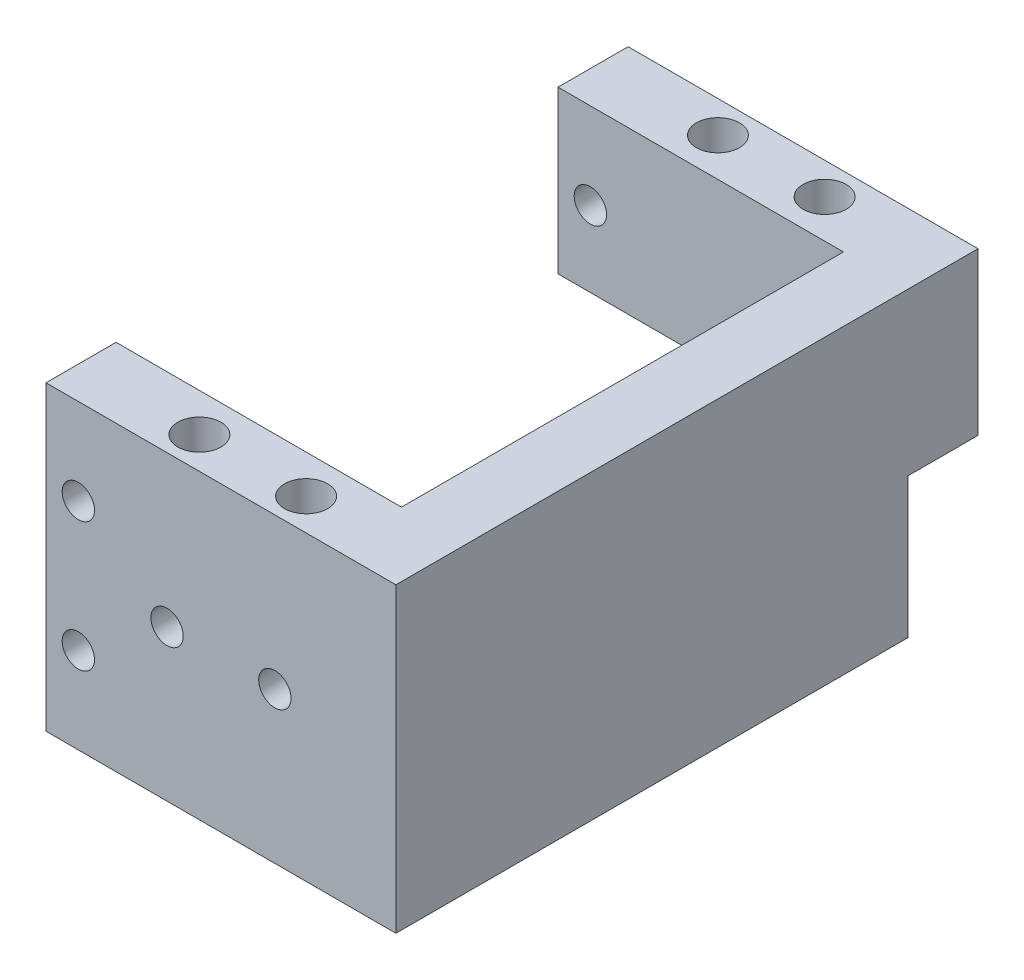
ISO-10303-21;
HEADER;
FILE_DESCRIPTION(('STEP AP214'),'2;1');
FILE_NAME('part.step','',(''),(''),'','','');
FILE_SCHEMA(('AUTOMOTIVE_DESIGN { 1 0 10303 214 1 1 1 1 }'));
ENDSEC;
DATA;
#1=APPLICATION_CONTEXT('core data for automotive mechanical design processes');
#2=APPLICATION_PROTOCOL_DEFINITION('international standard','automotive_design',2000,#1);
#3=PRODUCT_CONTEXT('',#1,'mechanical');
#4=PRODUCT('Part','Part','',(#3));
#5=PRODUCT_RELATED_PRODUCT_CATEGORY('part','',(#4));
#6=PRODUCT_DEFINITION_FORMATION('','',#4);
#7=PRODUCT_DEFINITION_CONTEXT('part definition',#1,'design');
#8=PRODUCT_DEFINITION('design','',#6,#7);
#9=PRODUCT_DEFINITION_SHAPE('','',#8);
#10=(LENGTH_UNIT() NAMED_UNIT(*) SI_UNIT(.MILLI.,.METRE.));
#11=(NAMED_UNIT(*) PLANE_ANGLE_UNIT() SI_UNIT($,.RADIAN.));
#12=(NAMED_UNIT(*) SI_UNIT($,.STERADIAN.) SOLID_ANGLE_UNIT());
#13=UNCERTAINTY_MEASURE_WITH_UNIT(LENGTH_MEASURE(1.E-05),#10,'distance_accuracy_value','');
#14=(GEOMETRIC_REPRESENTATION_CONTEXT(3) GLOBAL_UNCERTAINTY_ASSIGNED_CONTEXT((#13)) GLOBAL_UNIT_ASSIGNED_CONTEXT((#10,
#11,#12)) REPRESENTATION_CONTEXT('',''));
#15=CARTESIAN_POINT('',(0.,0.,0.));
#16=DIRECTION('',(0.,0.,1.));
#17=DIRECTION('',(1.,0.,0.));
#18=AXIS2_PLACEMENT_3D('',#15,#16,#17);
#19=CARTESIAN_POINT('',(-16.23,28.,0.));
#20=DIRECTION('',(-1.,0.,0.));
#21=DIRECTION('',(0.,0.,1.));
#22=AXIS2_PLACEMENT_3D('',#19,#20,#21);
#23=PLANE('',#22);
#24=DIRECTION('',(0.,-1.,0.));
#25=VECTOR('',#24,1.);
#26=CARTESIAN_POINT('',(-16.23,0.,-23.75));
#27=LINE('',#26,#25);
#28=CARTESIAN_POINT('',(-16.23,28.,-23.75));
#29=VERTEX_POINT('',#28);
#30=CARTESIAN_POINT('',(-16.23,13.,-23.75));
#31=VERTEX_POINT('',#30);
#32=EDGE_CURVE('E129',#29,#31,#27,.T.);
#33=ORIENTED_EDGE('',*,*,#32,.F.);
#34=DIRECTION('',(0.,0.,-1.));
#35=VECTOR('',#34,1.);
#36=CARTESIAN_POINT('',(-16.23,28.,0.));
#37=LINE('',#36,#35);
#38=CARTESIAN_POINT('',(-16.23,28.,-30.25));
#39=VERTEX_POINT('',#38);
#40=EDGE_CURVE('E120',#29,#39,#37,.T.);
#41=ORIENTED_EDGE('',*,*,#40,.T.);
#42=DIRECTION('',(0.,-1.,0.));
#43=VECTOR('',#42,1.);
#44=CARTESIAN_POINT('',(-16.23,28.,-30.25));
#45=LINE('',#44,#43);
#46=CARTESIAN_POINT('',(-16.23,13.,-30.25));
#47=VERTEX_POINT('',#46);
#48=EDGE_CURVE('E208',#39,#47,#45,.T.);
#49=ORIENTED_EDGE('',*,*,#48,.T.);
#50=DIRECTION('',(0.,0.,1.));
#51=VECTOR('',#50,1.);
#52=CARTESIAN_POINT('',(-16.23,13.,-23.75));
#53=LINE('',#52,#51);
#54=EDGE_CURVE('E213',#47,#31,#53,.T.);
#55=ORIENTED_EDGE('',*,*,#54,.T.);
#56=EDGE_LOOP('',(#33,#41,#49,#55));
#57=FACE_BOUND('',#56,.T.);
#58=ADVANCED_FACE('F35',(#57),#23,.T.);
#59=CARTESIAN_POINT('',(0.,28.,17.25));
#60=DIRECTION('',(0.,0.,-1.));
#61=DIRECTION('',(-1.,0.,0.));
#62=AXIS2_PLACEMENT_3D('',#59,#60,#61);
#63=PLANE('',#62);
#64=CARTESIAN_POINT('',(-13.23,20.,17.25));
#65=DIRECTION('',(0.,0.,-1.));
#66=DIRECTION('',(-1.,0.,0.));
#67=AXIS2_PLACEMENT_3D('',#64,#65,#66);
#68=CIRCLE('',#67,1.5);
#69=CARTESIAN_POINT('',(-14.73,20.,17.25));
#70=VERTEX_POINT('',#69);
#71=EDGE_CURVE('E406',#70,#70,#68,.T.);
#72=ORIENTED_EDGE('',*,*,#71,.F.);
#73=EDGE_LOOP('',(#72));
#74=FACE_BOUND('',#73,.T.);
#75=CARTESIAN_POINT('',(-13.23,7.99999999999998,17.25));
#76=DIRECTION('',(0.,0.,-1.));
#77=DIRECTION('',(-1.,0.,0.));
#78=AXIS2_PLACEMENT_3D('',#75,#76,#77);
#79=CIRCLE('',#78,1.5);
#80=CARTESIAN_POINT('',(-14.73,7.99999999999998,17.25));
#81=VERTEX_POINT('',#80);
#82=EDGE_CURVE('E318',#81,#81,#79,.T.);
#83=ORIENTED_EDGE('',*,*,#82,.F.);
#84=EDGE_LOOP('',(#83));
#85=FACE_BOUND('',#84,.T.);
#86=CARTESIAN_POINT('',(5.,14.,17.25));
#87=DIRECTION('',(0.,0.,-1.));
#88=DIRECTION('',(-1.,0.,0.));
#89=AXIS2_PLACEMENT_3D('',#86,#87,#88);
#90=CIRCLE('',#89,3.);
#91=CARTESIAN_POINT('',(2.,14.,17.25));
#92=VERTEX_POINT('',#91);
#93=EDGE_CURVE('E327',#92,#92,#90,.T.);
#94=ORIENTED_EDGE('',*,*,#93,.F.);
#95=EDGE_LOOP('',(#94));
#96=FACE_BOUND('',#95,.T.);
#97=DIRECTION('',(1.,0.,0.));
#98=VECTOR('',#97,1.);
#99=CARTESIAN_POINT('',(0.,0.,17.25));
#100=LINE('',#99,#98);
#101=CARTESIAN_POINT('',(-16.23,0.,17.25));
#102=VERTEX_POINT('',#101);
#103=CARTESIAN_POINT('',(10.25,0.,17.25));
#104=VERTEX_POINT('',#103);
#105=EDGE_CURVE('E51',#102,#104,#100,.T.);
#106=ORIENTED_EDGE('',*,*,#105,.F.);
#107=DIRECTION('',(0.,1.,0.));
#108=VECTOR('',#107,1.);
#109=CARTESIAN_POINT('',(-16.23,0.,17.25));
#110=LINE('',#109,#108);
#111=CARTESIAN_POINT('',(-16.23,28.,17.25));
#112=VERTEX_POINT('',#111);
#113=EDGE_CURVE('E122',#102,#112,#110,.T.);
#114=ORIENTED_EDGE('',*,*,#113,.T.);
#115=DIRECTION('',(1.,0.,0.));
#116=VECTOR('',#115,1.);
#117=CARTESIAN_POINT('',(0.,28.,17.25));
#118=LINE('',#117,#116);
#119=CARTESIAN_POINT('',(10.25,28.,17.25));
#120=VERTEX_POINT('',#119);
#121=EDGE_CURVE('E111',#112,#120,#118,.T.);
#122=ORIENTED_EDGE('',*,*,#121,.T.);
#123=DIRECTION('',(0.,-1.,0.));
#124=VECTOR('',#123,1.);
#125=CARTESIAN_POINT('',(10.25,28.,17.25));
#126=LINE('',#125,#124);
#127=EDGE_CURVE('E11',#120,#104,#126,.T.);
#128=ORIENTED_EDGE('',*,*,#127,.T.);
#129=EDGE_LOOP('',(#106,#114,#122,#128));
#130=FACE_BOUND('',#129,.T.);
#131=CARTESIAN_POINT('',(-5.,14.,17.25));
#132=DIRECTION('',(0.,0.,-1.));
#133=DIRECTION('',(-1.,0.,0.));
#134=AXIS2_PLACEMENT_3D('',#131,#132,#133);
#135=CIRCLE('',#134,3.);
#136=CARTESIAN_POINT('',(-8.00000000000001,14.,17.25));
#137=VERTEX_POINT('',#136);
#138=EDGE_CURVE('E128',#137,#137,#135,.F.);
#139=ORIENTED_EDGE('',*,*,#138,.T.);
#140=EDGE_LOOP('',(#139));
#141=FACE_BOUND('',#140,.T.);
#142=ADVANCED_FACE('F123',(#74,#85,#96,#130,#141),#63,.T.);
#143=CARTESIAN_POINT('',(-5.,14.,27.25));
#144=DIRECTION('',(0.,0.,-1.));
#145=DIRECTION('',(-1.,0.,0.));
#146=AXIS2_PLACEMENT_3D('',#143,#144,#145);
#147=CYLINDRICAL_SURFACE('',#146,1.5);
#148=CARTESIAN_POINT('',(-5.,14.,23.75));
#149=DIRECTION('',(0.,0.,-1.));
#150=DIRECTION('',(-1.,0.,0.));
#151=AXIS2_PLACEMENT_3D('',#148,#149,#150);
#152=CIRCLE('',#151,1.5);
#153=CARTESIAN_POINT('',(-6.5,14.,23.75));
#154=VERTEX_POINT('',#153);
#155=EDGE_CURVE('E174',#154,#154,#152,.F.);
#156=ORIENTED_EDGE('',*,*,#155,.T.);
#157=EDGE_LOOP('',(#156));
#158=FACE_BOUND('',#157,.T.);
#159=CARTESIAN_POINT('',(-5.,14.,20.75));
#160=DIRECTION('',(0.,0.,-1.));
#161=DIRECTION('',(-1.,0.,0.));
#162=AXIS2_PLACEMENT_3D('',#159,#160,#161);
#163=CIRCLE('',#162,1.5);
#164=CARTESIAN_POINT('',(-6.5,14.,20.75));
#165=VERTEX_POINT('',#164);
#166=EDGE_CURVE('E332',#165,#165,#163,.F.);
#167=ORIENTED_EDGE('',*,*,#166,.F.);
#168=EDGE_LOOP('',(#167));
#169=FACE_BOUND('',#168,.T.);
#170=ADVANCED_FACE('F276',(#158,#169),#147,.F.);
#171=CARTESIAN_POINT('',(5.,14.,27.25));
#172=DIRECTION('',(0.,0.,-1.));
#173=DIRECTION('',(-1.,0.,0.));
#174=AXIS2_PLACEMENT_3D('',#171,#172,#173);
#175=CYLINDRICAL_SURFACE('',#174,1.5);
#176=CARTESIAN_POINT('',(5.,14.,23.75));
#177=DIRECTION('',(0.,0.,-1.));
#178=DIRECTION('',(-1.,0.,0.));
#179=AXIS2_PLACEMENT_3D('',#176,#177,#178);
#180=CIRCLE('',#179,1.5);
#181=CARTESIAN_POINT('',(3.5,14.,23.75));
#182=VERTEX_POINT('',#181);
#183=EDGE_CURVE('E176',#182,#182,#180,.T.);
#184=ORIENTED_EDGE('',*,*,#183,.F.);
#185=EDGE_LOOP('',(#184));
#186=FACE_BOUND('',#185,.T.);
#187=CARTESIAN_POINT('',(5.,14.,20.75));
#188=DIRECTION('',(0.,0.,-1.));
#189=DIRECTION('',(-1.,0.,0.));
#190=AXIS2_PLACEMENT_3D('',#187,#188,#189);
#191=CIRCLE('',#190,1.5);
#192=CARTESIAN_POINT('',(3.5,14.,20.75));
#193=VERTEX_POINT('',#192);
#194=EDGE_CURVE('E324',#193,#193,#191,.T.);
#195=ORIENTED_EDGE('',*,*,#194,.T.);
#196=EDGE_LOOP('',(#195));
#197=FACE_BOUND('',#196,.T.);
#198=ADVANCED_FACE('F392',(#186,#197),#175,.F.);
#199=CARTESIAN_POINT('',(0.,28.,23.75));
#200=DIRECTION('',(0.,0.,-1.));
#201=DIRECTION('',(-1.,0.,0.));
#202=AXIS2_PLACEMENT_3D('',#199,#200,#201);
#203=PLANE('',#202);
#204=CARTESIAN_POINT('',(-13.23,20.,23.75));
#205=DIRECTION('',(0.,0.,-1.));
#206=DIRECTION('',(-1.,0.,0.));
#207=AXIS2_PLACEMENT_3D('',#204,#205,#206);
#208=CIRCLE('',#207,1.5);
#209=CARTESIAN_POINT('',(-14.73,20.,23.75));
#210=VERTEX_POINT('',#209);
#211=EDGE_CURVE('E402',#210,#210,#208,.T.);
#212=ORIENTED_EDGE('',*,*,#211,.T.);
#213=EDGE_LOOP('',(#212));
#214=FACE_BOUND('',#213,.T.);
#215=CARTESIAN_POINT('',(-13.23,7.99999999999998,23.75));
#216=DIRECTION('',(0.,0.,-1.));
#217=DIRECTION('',(-1.,0.,0.));
#218=AXIS2_PLACEMENT_3D('',#215,#216,#217);
#219=CIRCLE('',#218,1.5);
#220=CARTESIAN_POINT('',(-14.73,7.99999999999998,23.75));
#221=VERTEX_POINT('',#220);
#222=EDGE_CURVE('E39',#221,#221,#219,.T.);
#223=ORIENTED_EDGE('',*,*,#222,.T.);
#224=EDGE_LOOP('',(#223));
#225=FACE_BOUND('',#224,.T.);
#226=DIRECTION('',(1.,0.,0.));
#227=VECTOR('',#226,1.);
#228=CARTESIAN_POINT('',(0.,0.,23.75));
#229=LINE('',#228,#227);
#230=CARTESIAN_POINT('',(-16.23,0.,23.75));
#231=VERTEX_POINT('',#230);
#232=CARTESIAN_POINT('',(16.23,0.,23.75));
#233=VERTEX_POINT('',#232);
#234=EDGE_CURVE('E148',#231,#233,#229,.T.);
#235=ORIENTED_EDGE('',*,*,#234,.T.);
#236=DIRECTION('',(0.,-1.,0.));
#237=VECTOR('',#236,1.);
#238=CARTESIAN_POINT('',(16.23,28.,23.75));
#239=LINE('',#238,#237);
#240=CARTESIAN_POINT('',(16.23,28.,23.75));
#241=VERTEX_POINT('',#240);
#242=EDGE_CURVE('E161',#241,#233,#239,.T.);
#243=ORIENTED_EDGE('',*,*,#242,.F.);
#244=DIRECTION('',(1.,0.,0.));
#245=VECTOR('',#244,1.);
#246=CARTESIAN_POINT('',(0.,28.,23.75));
#247=LINE('',#246,#245);
#248=CARTESIAN_POINT('',(-16.23,28.,23.75));
#249=VERTEX_POINT('',#248);
#250=EDGE_CURVE('E133',#249,#241,#247,.T.);
#251=ORIENTED_EDGE('',*,*,#250,.F.);
#252=DIRECTION('',(0.,-1.,0.));
#253=VECTOR('',#252,1.);
#254=CARTESIAN_POINT('',(-16.23,28.,23.75));
#255=LINE('',#254,#253);
#256=EDGE_CURVE('E44',#249,#231,#255,.T.);
#257=ORIENTED_EDGE('',*,*,#256,.T.);
#258=EDGE_LOOP('',(#235,#243,#251,#257));
#259=FACE_BOUND('',#258,.T.);
#260=ORIENTED_EDGE('',*,*,#155,.F.);
#261=EDGE_LOOP('',(#260));
#262=FACE_BOUND('',#261,.T.);
#263=ORIENTED_EDGE('',*,*,#183,.T.);
#264=EDGE_LOOP('',(#263));
#265=FACE_BOUND('',#264,.T.);
#266=ADVANCED_FACE('F246',(#214,#225,#259,#262,#265),#203,.F.);
#267=CARTESIAN_POINT('',(0.,0.,0.));
#268=DIRECTION('',(0.,1.,0.));
#269=DIRECTION('',(0.,0.,1.));
#270=AXIS2_PLACEMENT_3D('',#267,#268,#269);
#271=PLANE('',#270);
#272=CARTESIAN_POINT('',(13.23,0.,13.25));
#273=DIRECTION('',(0.,1.,0.));
#274=DIRECTION('',(0.,0.,1.));
#275=AXIS2_PLACEMENT_3D('',#272,#273,#274);
#276=CIRCLE('',#275,1.5);
#277=CARTESIAN_POINT('',(13.23,0.,14.75));
#278=VERTEX_POINT('',#277);
#279=EDGE_CURVE('E222',#278,#278,#276,.T.);
#280=ORIENTED_EDGE('',*,*,#279,.T.);
#281=EDGE_LOOP('',(#280));
#282=FACE_BOUND('',#281,.T.);
#283=DIRECTION('',(0.,0.,-1.));
#284=VECTOR('',#283,1.);
#285=CARTESIAN_POINT('',(-16.23,0.,0.));
#286=LINE('',#285,#284);
#287=EDGE_CURVE('E146',#231,#102,#286,.T.);
#288=ORIENTED_EDGE('',*,*,#287,.T.);
#289=ORIENTED_EDGE('',*,*,#105,.T.);
#290=DIRECTION('',(0.,0.,1.));
#291=VECTOR('',#290,1.);
#292=CARTESIAN_POINT('',(10.25,0.,0.));
#293=LINE('',#292,#291);
#294=CARTESIAN_POINT('',(10.25,0.,-23.75));
#295=VERTEX_POINT('',#294);
#296=EDGE_CURVE('E141',#295,#104,#293,.T.);
#297=ORIENTED_EDGE('',*,*,#296,.F.);
#298=DIRECTION('',(1.,0.,0.));
#299=VECTOR('',#298,1.);
#300=CARTESIAN_POINT('',(0.,0.,-23.75));
#301=LINE('',#300,#299);
#302=CARTESIAN_POINT('',(16.23,0.,-23.75));
#303=VERTEX_POINT('',#302);
#304=EDGE_CURVE('E153',#295,#303,#301,.T.);
#305=ORIENTED_EDGE('',*,*,#304,.T.);
#306=DIRECTION('',(0.,0.,-1.));
#307=VECTOR('',#306,1.);
#308=CARTESIAN_POINT('',(16.23,0.,0.));
#309=LINE('',#308,#307);
#310=EDGE_CURVE('E150',#233,#303,#309,.T.);
#311=ORIENTED_EDGE('',*,*,#310,.F.);
#312=ORIENTED_EDGE('',*,*,#234,.F.);
#313=EDGE_LOOP('',(#288,#289,#297,#305,#311,#312));
#314=FACE_BOUND('',#313,.T.);
#315=CARTESIAN_POINT('',(13.23,0.,-19.75));
#316=DIRECTION('',(0.,1.,0.));
#317=DIRECTION('',(0.,0.,1.));
#318=AXIS2_PLACEMENT_3D('',#315,#316,#317);
#319=CIRCLE('',#318,1.5);
#320=CARTESIAN_POINT('',(13.23,0.,-18.25));
#321=VERTEX_POINT('',#320);
#322=EDGE_CURVE('E233',#321,#321,#319,.F.);
#323=ORIENTED_EDGE('',*,*,#322,.F.);
#324=EDGE_LOOP('',(#323));
#325=FACE_BOUND('',#324,.T.);
#326=CARTESIAN_POINT('',(4.95,0.,20.8));
#327=DIRECTION('',(0.,1.,0.));
#328=DIRECTION('',(0.,0.,1.));
#329=AXIS2_PLACEMENT_3D('',#326,#327,#328);
#330=CIRCLE('',#329,2.);
#331=CARTESIAN_POINT('',(4.95,0.,22.8));
#332=VERTEX_POINT('',#331);
#333=EDGE_CURVE('E200',#332,#332,#330,.T.);
#334=ORIENTED_EDGE('',*,*,#333,.T.);
#335=EDGE_LOOP('',(#334));
#336=FACE_BOUND('',#335,.T.);
#337=CARTESIAN_POINT('',(-4.95,0.,20.8));
#338=DIRECTION('',(0.,1.,0.));
#339=DIRECTION('',(0.,0.,1.));
#340=AXIS2_PLACEMENT_3D('',#337,#338,#339);
#341=CIRCLE('',#340,2.);
#342=CARTESIAN_POINT('',(-4.95,0.,22.8));
#343=VERTEX_POINT('',#342);
#344=EDGE_CURVE('E194',#343,#343,#341,.F.);
#345=ORIENTED_EDGE('',*,*,#344,.F.);
#346=EDGE_LOOP('',(#345));
#347=FACE_BOUND('',#346,.T.);
#348=ADVANCED_FACE('F243',(#282,#314,#325,#336,#347),#271,.F.);
#349=CARTESIAN_POINT('',(0.,28.,0.));
#350=DIRECTION('',(0.,1.,0.));
#351=DIRECTION('',(0.,0.,1.));
#352=AXIS2_PLACEMENT_3D('',#349,#350,#351);
#353=PLANE('',#352);
#354=ORIENTED_EDGE('',*,*,#40,.F.);
#355=DIRECTION('',(-1.,0.,0.));
#356=VECTOR('',#355,1.);
#357=CARTESIAN_POINT('',(16.23,28.,-23.75));
#358=LINE('',#357,#356);
#359=CARTESIAN_POINT('',(10.25,28.,-23.75));
#360=VERTEX_POINT('',#359);
#361=EDGE_CURVE('E216',#360,#29,#358,.T.);
#362=ORIENTED_EDGE('',*,*,#361,.F.);
#363=DIRECTION('',(0.,0.,1.));
#364=VECTOR('',#363,1.);
#365=CARTESIAN_POINT('',(10.25,28.,0.));
#366=LINE('',#365,#364);
#367=EDGE_CURVE('E118',#360,#120,#366,.T.);
#368=ORIENTED_EDGE('',*,*,#367,.T.);
#369=ORIENTED_EDGE('',*,*,#121,.F.);
#370=EDGE_CURVE('E116',#249,#112,#37,.T.);
#371=ORIENTED_EDGE('',*,*,#370,.F.);
#372=ORIENTED_EDGE('',*,*,#250,.T.);
#373=DIRECTION('',(0.,0.,-1.));
#374=VECTOR('',#373,1.);
#375=CARTESIAN_POINT('',(16.23,28.,0.));
#376=LINE('',#375,#374);
#377=CARTESIAN_POINT('',(16.23,28.,-30.25));
#378=VERTEX_POINT('',#377);
#379=EDGE_CURVE('E135',#241,#378,#376,.T.);
#380=ORIENTED_EDGE('',*,*,#379,.T.);
#381=DIRECTION('',(-1.,0.,0.));
#382=VECTOR('',#381,1.);
#383=CARTESIAN_POINT('',(16.23,28.,-30.25));
#384=LINE('',#383,#382);
#385=EDGE_CURVE('E226',#378,#39,#384,.T.);
#386=ORIENTED_EDGE('',*,*,#385,.T.);
#387=EDGE_LOOP('',(#354,#362,#368,#369,#371,#372,#380,#386));
#388=FACE_BOUND('',#387,.T.);
#389=CARTESIAN_POINT('',(-4.95,28.,20.8));
#390=DIRECTION('',(0.,1.,0.));
#391=DIRECTION('',(0.,0.,1.));
#392=AXIS2_PLACEMENT_3D('',#389,#390,#391);
#393=CIRCLE('',#392,2.);
#394=CARTESIAN_POINT('',(-4.95,28.,22.8));
#395=VERTEX_POINT('',#394);
#396=EDGE_CURVE('E188',#395,#395,#393,.T.);
#397=ORIENTED_EDGE('',*,*,#396,.F.);
#398=EDGE_LOOP('',(#397));
#399=FACE_BOUND('',#398,.T.);
#400=CARTESIAN_POINT('',(4.95,28.,20.8));
#401=DIRECTION('',(0.,1.,0.));
#402=DIRECTION('',(0.,0.,1.));
#403=AXIS2_PLACEMENT_3D('',#400,#401,#402);
#404=CIRCLE('',#403,2.);
#405=CARTESIAN_POINT('',(4.95,28.,22.8));
#406=VERTEX_POINT('',#405);
#407=EDGE_CURVE('E179',#406,#406,#404,.T.);
#408=ORIENTED_EDGE('',*,*,#407,.F.);
#409=EDGE_LOOP('',(#408));
#410=FACE_BOUND('',#409,.T.);
#411=CARTESIAN_POINT('',(4.95,28.,-27.3));
#412=DIRECTION('',(0.,1.,0.));
#413=DIRECTION('',(0.,0.,1.));
#414=AXIS2_PLACEMENT_3D('',#411,#412,#413);
#415=CIRCLE('',#414,2.);
#416=CARTESIAN_POINT('',(4.95,28.,-25.3));
#417=VERTEX_POINT('',#416);
#418=EDGE_CURVE('E168',#417,#417,#415,.T.);
#419=ORIENTED_EDGE('',*,*,#418,.F.);
#420=EDGE_LOOP('',(#419));
#421=FACE_BOUND('',#420,.T.);
#422=CARTESIAN_POINT('',(-4.95,28.,-27.3));
#423=DIRECTION('',(0.,1.,0.));
#424=DIRECTION('',(0.,0.,1.));
#425=AXIS2_PLACEMENT_3D('',#422,#423,#424);
#426=CIRCLE('',#425,2.);
#427=CARTESIAN_POINT('',(-4.95,28.,-25.3));
#428=VERTEX_POINT('',#427);
#429=EDGE_CURVE('E173',#428,#428,#426,.F.);
#430=ORIENTED_EDGE('',*,*,#429,.T.);
#431=EDGE_LOOP('',(#430));
#432=FACE_BOUND('',#431,.T.);
#433=ADVANCED_FACE('F113',(#388,#399,#410,#421,#432),#353,.T.);
#434=CARTESIAN_POINT('',(16.23,13.,-23.75));
#435=DIRECTION('',(0.,-1.,0.));
#436=DIRECTION('',(0.,0.,-1.));
#437=AXIS2_PLACEMENT_3D('',#434,#435,#436);
#438=PLANE('',#437);
#439=ORIENTED_EDGE('',*,*,#54,.F.);
#440=DIRECTION('',(-1.,0.,0.));
#441=VECTOR('',#440,1.);
#442=CARTESIAN_POINT('',(16.23,13.,-30.25));
#443=LINE('',#442,#441);
#444=CARTESIAN_POINT('',(16.23,13.,-30.25));
#445=VERTEX_POINT('',#444);
#446=EDGE_CURVE('E224',#445,#47,#443,.T.);
#447=ORIENTED_EDGE('',*,*,#446,.F.);
#448=DIRECTION('',(0.,0.,1.));
#449=VECTOR('',#448,1.);
#450=CARTESIAN_POINT('',(16.23,13.,-23.75));
#451=LINE('',#450,#449);
#452=CARTESIAN_POINT('',(16.23,13.,-23.75));
#453=VERTEX_POINT('',#452);
#454=EDGE_CURVE('E212',#445,#453,#451,.T.);
#455=ORIENTED_EDGE('',*,*,#454,.T.);
#456=DIRECTION('',(-1.,0.,0.));
#457=VECTOR('',#456,1.);
#458=CARTESIAN_POINT('',(16.23,13.,-23.75));
#459=LINE('',#458,#457);
#460=CARTESIAN_POINT('',(10.25,13.,-23.75));
#461=VERTEX_POINT('',#460);
#462=EDGE_CURVE('E59',#453,#461,#459,.T.);
#463=ORIENTED_EDGE('',*,*,#462,.T.);
#464=EDGE_CURVE('E223',#461,#31,#459,.T.);
#465=ORIENTED_EDGE('',*,*,#464,.T.);
#466=EDGE_LOOP('',(#439,#447,#455,#463,#465));
#467=FACE_BOUND('',#466,.T.);
#468=CARTESIAN_POINT('',(4.95,13.,-27.3));
#469=DIRECTION('',(0.,-1.,0.));
#470=DIRECTION('',(0.,0.,-1.));
#471=AXIS2_PLACEMENT_3D('',#468,#469,#470);
#472=CIRCLE('',#471,2.);
#473=CARTESIAN_POINT('',(4.95,13.,-29.3));
#474=VERTEX_POINT('',#473);
#475=EDGE_CURVE('E165',#474,#474,#472,.T.);
#476=ORIENTED_EDGE('',*,*,#475,.F.);
#477=EDGE_LOOP('',(#476));
#478=FACE_BOUND('',#477,.T.);
#479=CARTESIAN_POINT('',(-4.95,13.,-27.3));
#480=DIRECTION('',(0.,-1.,0.));
#481=DIRECTION('',(0.,0.,-1.));
#482=AXIS2_PLACEMENT_3D('',#479,#480,#481);
#483=CIRCLE('',#482,2.);
#484=CARTESIAN_POINT('',(-4.95,13.,-29.3));
#485=VERTEX_POINT('',#484);
#486=EDGE_CURVE('E170',#485,#485,#483,.F.);
#487=ORIENTED_EDGE('',*,*,#486,.T.);
#488=EDGE_LOOP('',(#487));
#489=FACE_BOUND('',#488,.T.);
#490=ADVANCED_FACE('F289',(#467,#478,#489),#438,.T.);
#491=CARTESIAN_POINT('',(10.25,28.,0.));
#492=DIRECTION('',(1.,0.,0.));
#493=DIRECTION('',(0.,0.,-1.));
#494=AXIS2_PLACEMENT_3D('',#491,#492,#493);
#495=PLANE('',#494);
#496=ORIENTED_EDGE('',*,*,#296,.T.);
#497=ORIENTED_EDGE('',*,*,#127,.F.);
#498=ORIENTED_EDGE('',*,*,#367,.F.);
#499=DIRECTION('',(0.,-1.,0.));
#500=VECTOR('',#499,1.);
#501=CARTESIAN_POINT('',(10.25,28.,-23.75));
#502=LINE('',#501,#500);
#503=EDGE_CURVE('E156',#360,#461,#502,.T.);
#504=ORIENTED_EDGE('',*,*,#503,.T.);
#505=EDGE_CURVE('E140',#461,#295,#502,.T.);
#506=ORIENTED_EDGE('',*,*,#505,.T.);
#507=EDGE_LOOP('',(#496,#497,#498,#504,#506));
#508=FACE_BOUND('',#507,.T.);
#509=ADVANCED_FACE('F37',(#508),#495,.F.);
#510=ORIENTED_EDGE('',*,*,#113,.F.);
#511=ORIENTED_EDGE('',*,*,#287,.F.);
#512=ORIENTED_EDGE('',*,*,#256,.F.);
#513=ORIENTED_EDGE('',*,*,#370,.T.);
#514=EDGE_LOOP('',(#510,#511,#512,#513));
#515=FACE_BOUND('',#514,.T.);
#516=ADVANCED_FACE('F131',(#515),#23,.T.);
#517=CARTESIAN_POINT('',(16.23,28.,0.));
#518=DIRECTION('',(-1.,0.,0.));
#519=DIRECTION('',(0.,0.,1.));
#520=AXIS2_PLACEMENT_3D('',#517,#518,#519);
#521=PLANE('',#520);
#522=ORIENTED_EDGE('',*,*,#310,.T.);
#523=DIRECTION('',(0.,-1.,0.));
#524=VECTOR('',#523,1.);
#525=CARTESIAN_POINT('',(16.23,28.,-23.75));
#526=LINE('',#525,#524);
#527=EDGE_CURVE('E159',#453,#303,#526,.T.);
#528=ORIENTED_EDGE('',*,*,#527,.F.);
#529=ORIENTED_EDGE('',*,*,#454,.F.);
#530=DIRECTION('',(0.,-1.,0.));
#531=VECTOR('',#530,1.);
#532=CARTESIAN_POINT('',(16.23,28.,-30.25));
#533=LINE('',#532,#531);
#534=EDGE_CURVE('E209',#378,#445,#533,.T.);
#535=ORIENTED_EDGE('',*,*,#534,.F.);
#536=ORIENTED_EDGE('',*,*,#379,.F.);
#537=ORIENTED_EDGE('',*,*,#242,.T.);
#538=EDGE_LOOP('',(#522,#528,#529,#535,#536,#537));
#539=FACE_BOUND('',#538,.T.);
#540=ADVANCED_FACE('F281',(#539),#521,.F.);
#541=CARTESIAN_POINT('',(0.,28.,-23.75));
#542=DIRECTION('',(0.,0.,-1.));
#543=DIRECTION('',(-1.,0.,0.));
#544=AXIS2_PLACEMENT_3D('',#541,#542,#543);
#545=PLANE('',#544);
#546=ORIENTED_EDGE('',*,*,#462,.F.);
#547=ORIENTED_EDGE('',*,*,#527,.T.);
#548=ORIENTED_EDGE('',*,*,#304,.F.);
#549=ORIENTED_EDGE('',*,*,#505,.F.);
#550=EDGE_LOOP('',(#546,#547,#548,#549));
#551=FACE_BOUND('',#550,.T.);
#552=ADVANCED_FACE('F286',(#551),#545,.T.);
#553=CARTESIAN_POINT('',(13.23,15.,-19.75));
#554=DIRECTION('',(0.,-1.,0.));
#555=DIRECTION('',(0.,0.,-1.));
#556=AXIS2_PLACEMENT_3D('',#553,#554,#555);
#557=CYLINDRICAL_SURFACE('',#556,1.5);
#558=CARTESIAN_POINT('',(13.23,15.,-19.75));
#559=DIRECTION('',(0.,1.,0.));
#560=DIRECTION('',(0.,0.,1.));
#561=AXIS2_PLACEMENT_3D('',#558,#559,#560);
#562=CIRCLE('',#561,1.5);
#563=CARTESIAN_POINT('',(13.23,15.,-18.25));
#564=VERTEX_POINT('',#563);
#565=EDGE_CURVE('E144',#564,#564,#562,.F.);
#566=ORIENTED_EDGE('',*,*,#565,.F.);
#567=EDGE_LOOP('',(#566));
#568=FACE_BOUND('',#567,.T.);
#569=ORIENTED_EDGE('',*,*,#322,.T.);
#570=EDGE_LOOP('',(#569));
#571=FACE_BOUND('',#570,.T.);
#572=ADVANCED_FACE('F241',(#568,#571),#557,.F.);
#573=CARTESIAN_POINT('',(0.,15.,0.));
#574=DIRECTION('',(0.,1.,0.));
#575=DIRECTION('',(0.,0.,1.));
#576=AXIS2_PLACEMENT_3D('',#573,#574,#575);
#577=PLANE('',#576);
#578=ORIENTED_EDGE('',*,*,#565,.T.);
#579=EDGE_LOOP('',(#578));
#580=FACE_BOUND('',#579,.T.);
#581=ADVANCED_FACE('F382',(#580),#577,.F.);
#582=CARTESIAN_POINT('',(13.23,15.,13.25));
#583=DIRECTION('',(0.,-1.,0.));
#584=DIRECTION('',(0.,0.,-1.));
#585=AXIS2_PLACEMENT_3D('',#582,#583,#584);
#586=CYLINDRICAL_SURFACE('',#585,1.5);
#587=CARTESIAN_POINT('',(13.23,15.,13.25));
#588=DIRECTION('',(0.,1.,0.));
#589=DIRECTION('',(0.,0.,1.));
#590=AXIS2_PLACEMENT_3D('',#587,#588,#589);
#591=CIRCLE('',#590,1.5);
#592=CARTESIAN_POINT('',(13.23,15.,14.75));
#593=VERTEX_POINT('',#592);
#594=EDGE_CURVE('E230',#593,#593,#591,.T.);
#595=ORIENTED_EDGE('',*,*,#594,.T.);
#596=EDGE_LOOP('',(#595));
#597=FACE_BOUND('',#596,.T.);
#598=ORIENTED_EDGE('',*,*,#279,.F.);
#599=EDGE_LOOP('',(#598));
#600=FACE_BOUND('',#599,.T.);
#601=ADVANCED_FACE('F378',(#597,#600),#586,.F.);
#602=CARTESIAN_POINT('',(0.,15.,0.));
#603=DIRECTION('',(0.,1.,0.));
#604=DIRECTION('',(0.,0.,1.));
#605=AXIS2_PLACEMENT_3D('',#602,#603,#604);
#606=PLANE('',#605);
#607=ORIENTED_EDGE('',*,*,#594,.F.);
#608=EDGE_LOOP('',(#607));
#609=FACE_BOUND('',#608,.T.);
#610=ADVANCED_FACE('F374',(#609),#606,.F.);
#611=CARTESIAN_POINT('',(16.23,28.,-23.75));
#612=DIRECTION('',(0.,0.,1.));
#613=DIRECTION('',(0.,-1.,0.));
#614=AXIS2_PLACEMENT_3D('',#611,#612,#613);
#615=PLANE('',#614);
#616=CARTESIAN_POINT('',(-13.23,20.,-23.75));
#617=DIRECTION('',(0.,0.,1.));
#618=DIRECTION('',(0.,-1.,0.));
#619=AXIS2_PLACEMENT_3D('',#616,#617,#618);
#620=CIRCLE('',#619,1.5);
#621=CARTESIAN_POINT('',(-13.23,18.5,-23.75));
#622=VERTEX_POINT('',#621);
#623=EDGE_CURVE('E410',#622,#622,#620,.T.);
#624=ORIENTED_EDGE('',*,*,#623,.F.);
#625=EDGE_LOOP('',(#624));
#626=FACE_BOUND('',#625,.T.);
#627=ORIENTED_EDGE('',*,*,#503,.F.);
#628=ORIENTED_EDGE('',*,*,#361,.T.);
#629=ORIENTED_EDGE('',*,*,#32,.T.);
#630=ORIENTED_EDGE('',*,*,#464,.F.);
#631=EDGE_LOOP('',(#627,#628,#629,#630));
#632=FACE_BOUND('',#631,.T.);
#633=ADVANCED_FACE('F317',(#626,#632),#615,.T.);
#634=CARTESIAN_POINT('',(16.23,28.,-30.25));
#635=DIRECTION('',(0.,0.,-1.));
#636=DIRECTION('',(0.,1.,0.));
#637=AXIS2_PLACEMENT_3D('',#634,#635,#636);
#638=PLANE('',#637);
#639=CARTESIAN_POINT('',(-13.23,20.,-30.25));
#640=DIRECTION('',(0.,0.,-1.));
#641=DIRECTION('',(0.,1.,0.));
#642=AXIS2_PLACEMENT_3D('',#639,#640,#641);
#643=CIRCLE('',#642,1.5);
#644=CARTESIAN_POINT('',(-13.23,21.5,-30.25));
#645=VERTEX_POINT('',#644);
#646=EDGE_CURVE('E415',#645,#645,#643,.T.);
#647=ORIENTED_EDGE('',*,*,#646,.F.);
#648=EDGE_LOOP('',(#647));
#649=FACE_BOUND('',#648,.T.);
#650=ORIENTED_EDGE('',*,*,#48,.F.);
#651=ORIENTED_EDGE('',*,*,#385,.F.);
#652=ORIENTED_EDGE('',*,*,#534,.T.);
#653=ORIENTED_EDGE('',*,*,#446,.T.);
#654=EDGE_LOOP('',(#650,#651,#652,#653));
#655=FACE_BOUND('',#654,.T.);
#656=ADVANCED_FACE('F310',(#649,#655),#638,.T.);
#657=CARTESIAN_POINT('',(4.95,94.46,-27.3));
#658=DIRECTION('',(0.,-1.,0.));
#659=DIRECTION('',(0.,0.,-1.));
#660=AXIS2_PLACEMENT_3D('',#657,#658,#659);
#661=CYLINDRICAL_SURFACE('',#660,2.);
#662=ORIENTED_EDGE('',*,*,#418,.T.);
#663=EDGE_LOOP('',(#662));
#664=FACE_BOUND('',#663,.T.);
#665=ORIENTED_EDGE('',*,*,#475,.T.);
#666=EDGE_LOOP('',(#665));
#667=FACE_BOUND('',#666,.T.);
#668=ADVANCED_FACE('F356',(#664,#667),#661,.F.);
#669=CARTESIAN_POINT('',(-4.95,94.46,-27.3));
#670=DIRECTION('',(0.,-1.,0.));
#671=DIRECTION('',(0.,0.,-1.));
#672=AXIS2_PLACEMENT_3D('',#669,#670,#671);
#673=CYLINDRICAL_SURFACE('',#672,2.);
#674=ORIENTED_EDGE('',*,*,#429,.F.);
#675=EDGE_LOOP('',(#674));
#676=FACE_BOUND('',#675,.T.);
#677=ORIENTED_EDGE('',*,*,#486,.F.);
#678=EDGE_LOOP('',(#677));
#679=FACE_BOUND('',#678,.T.);
#680=ADVANCED_FACE('F353',(#676,#679),#673,.F.);
#681=CARTESIAN_POINT('',(4.95,8.,20.8));
#682=DIRECTION('',(0.,-1.,0.));
#683=DIRECTION('',(0.,0.,-1.));
#684=AXIS2_PLACEMENT_3D('',#681,#682,#683);
#685=CYLINDRICAL_SURFACE('',#684,2.);
#686=CARTESIAN_POINT('',(4.95,8.,20.8));
#687=DIRECTION('',(0.,1.,0.));
#688=DIRECTION('',(0.,0.,1.));
#689=AXIS2_PLACEMENT_3D('',#686,#687,#688);
#690=CIRCLE('',#689,2.);
#691=CARTESIAN_POINT('',(4.95,8.,22.8));
#692=VERTEX_POINT('',#691);
#693=EDGE_CURVE('E197',#692,#692,#690,.T.);
#694=ORIENTED_EDGE('',*,*,#693,.T.);
#695=EDGE_LOOP('',(#694));
#696=FACE_BOUND('',#695,.T.);
#697=ORIENTED_EDGE('',*,*,#333,.F.);
#698=EDGE_LOOP('',(#697));
#699=FACE_BOUND('',#698,.T.);
#700=ADVANCED_FACE('F266',(#696,#699),#685,.F.);
#701=CARTESIAN_POINT('',(0.,8.,0.));
#702=DIRECTION('',(0.,1.,0.));
#703=DIRECTION('',(0.,0.,1.));
#704=AXIS2_PLACEMENT_3D('',#701,#702,#703);
#705=PLANE('',#704);
#706=ORIENTED_EDGE('',*,*,#693,.F.);
#707=EDGE_LOOP('',(#706));
#708=FACE_BOUND('',#707,.T.);
#709=ADVANCED_FACE('F256',(#708),#705,.F.);
#710=CARTESIAN_POINT('',(-4.95,8.,20.8));
#711=DIRECTION('',(0.,-1.,0.));
#712=DIRECTION('',(0.,0.,-1.));
#713=AXIS2_PLACEMENT_3D('',#710,#711,#712);
#714=CYLINDRICAL_SURFACE('',#713,2.);
#715=CARTESIAN_POINT('',(-4.95,8.,20.8));
#716=DIRECTION('',(0.,1.,0.));
#717=DIRECTION('',(0.,0.,1.));
#718=AXIS2_PLACEMENT_3D('',#715,#716,#717);
#719=CIRCLE('',#718,2.);
#720=CARTESIAN_POINT('',(-4.95,8.,22.8));
#721=VERTEX_POINT('',#720);
#722=EDGE_CURVE('E169',#721,#721,#719,.F.);
#723=ORIENTED_EDGE('',*,*,#722,.F.);
#724=EDGE_LOOP('',(#723));
#725=FACE_BOUND('',#724,.T.);
#726=ORIENTED_EDGE('',*,*,#344,.T.);
#727=EDGE_LOOP('',(#726));
#728=FACE_BOUND('',#727,.T.);
#729=ADVANCED_FACE('F253',(#725,#728),#714,.F.);
#730=CARTESIAN_POINT('',(0.,8.,0.));
#731=DIRECTION('',(0.,1.,0.));
#732=DIRECTION('',(0.,0.,1.));
#733=AXIS2_PLACEMENT_3D('',#730,#731,#732);
#734=PLANE('',#733);
#735=ORIENTED_EDGE('',*,*,#722,.T.);
#736=EDGE_LOOP('',(#735));
#737=FACE_BOUND('',#736,.T.);
#738=ADVANCED_FACE('F255',(#737),#734,.F.);
#739=CARTESIAN_POINT('',(4.95,20.,20.8));
#740=DIRECTION('',(0.,1.,0.));
#741=DIRECTION('',(0.,0.,1.));
#742=AXIS2_PLACEMENT_3D('',#739,#740,#741);
#743=CYLINDRICAL_SURFACE('',#742,2.);
#744=CARTESIAN_POINT('',(4.95,20.,20.8));
#745=DIRECTION('',(0.,1.,0.));
#746=DIRECTION('',(0.,0.,1.));
#747=AXIS2_PLACEMENT_3D('',#744,#745,#746);
#748=CIRCLE('',#747,2.);
#749=CARTESIAN_POINT('',(4.95,20.,22.8));
#750=VERTEX_POINT('',#749);
#751=EDGE_CURVE('E183',#750,#750,#748,.T.);
#752=ORIENTED_EDGE('',*,*,#751,.F.);
#753=EDGE_LOOP('',(#752));
#754=FACE_BOUND('',#753,.T.);
#755=ORIENTED_EDGE('',*,*,#407,.T.);
#756=EDGE_LOOP('',(#755));
#757=FACE_BOUND('',#756,.T.);
#758=ADVANCED_FACE('F263',(#754,#757),#743,.F.);
#759=CARTESIAN_POINT('',(4.95,20.,20.8));
#760=DIRECTION('',(0.,1.,0.));
#761=DIRECTION('',(0.,0.,1.));
#762=AXIS2_PLACEMENT_3D('',#759,#760,#761);
#763=PLANE('',#762);
#764=ORIENTED_EDGE('',*,*,#751,.T.);
#765=EDGE_LOOP('',(#764));
#766=FACE_BOUND('',#765,.T.);
#767=ADVANCED_FACE('F578',(#766),#763,.T.);
#768=CARTESIAN_POINT('',(-4.95,20.,20.8));
#769=DIRECTION('',(0.,1.,0.));
#770=DIRECTION('',(0.,0.,1.));
#771=AXIS2_PLACEMENT_3D('',#768,#769,#770);
#772=CYLINDRICAL_SURFACE('',#771,2.);
#773=CARTESIAN_POINT('',(-4.95,20.,20.8));
#774=DIRECTION('',(0.,1.,0.));
#775=DIRECTION('',(0.,0.,1.));
#776=AXIS2_PLACEMENT_3D('',#773,#774,#775);
#777=CIRCLE('',#776,2.);
#778=CARTESIAN_POINT('',(-4.95,20.,22.8));
#779=VERTEX_POINT('',#778);
#780=EDGE_CURVE('E203',#779,#779,#777,.T.);
#781=ORIENTED_EDGE('',*,*,#780,.F.);
#782=EDGE_LOOP('',(#781));
#783=FACE_BOUND('',#782,.T.);
#784=ORIENTED_EDGE('',*,*,#396,.T.);
#785=EDGE_LOOP('',(#784));
#786=FACE_BOUND('',#785,.T.);
#787=ADVANCED_FACE('F344',(#783,#786),#772,.F.);
#788=CARTESIAN_POINT('',(-4.95,20.,20.8));
#789=DIRECTION('',(0.,1.,0.));
#790=DIRECTION('',(0.,0.,1.));
#791=AXIS2_PLACEMENT_3D('',#788,#789,#790);
#792=PLANE('',#791);
#793=ORIENTED_EDGE('',*,*,#780,.T.);
#794=EDGE_LOOP('',(#793));
#795=FACE_BOUND('',#794,.T.);
#796=ADVANCED_FACE('F546',(#795),#792,.T.);
#797=CARTESIAN_POINT('',(5.,14.,20.75));
#798=DIRECTION('',(0.,0.,-1.));
#799=DIRECTION('',(-1.,0.,0.));
#800=AXIS2_PLACEMENT_3D('',#797,#798,#799);
#801=CYLINDRICAL_SURFACE('',#800,3.);
#802=CARTESIAN_POINT('',(5.,14.,20.75));
#803=DIRECTION('',(0.,0.,-1.));
#804=DIRECTION('',(-1.,0.,0.));
#805=AXIS2_PLACEMENT_3D('',#802,#803,#804);
#806=CIRCLE('',#805,3.);
#807=CARTESIAN_POINT('',(2.,14.,20.75));
#808=VERTEX_POINT('',#807);
#809=EDGE_CURVE('E177',#808,#808,#806,.T.);
#810=ORIENTED_EDGE('',*,*,#809,.F.);
#811=EDGE_LOOP('',(#810));
#812=FACE_BOUND('',#811,.T.);
#813=ORIENTED_EDGE('',*,*,#93,.T.);
#814=EDGE_LOOP('',(#813));
#815=FACE_BOUND('',#814,.T.);
#816=ADVANCED_FACE('F535',(#812,#815),#801,.F.);
#817=CARTESIAN_POINT('',(0.,0.,20.75));
#818=DIRECTION('',(0.,0.,-1.));
#819=DIRECTION('',(-1.,0.,0.));
#820=AXIS2_PLACEMENT_3D('',#817,#818,#819);
#821=PLANE('',#820);
#822=ORIENTED_EDGE('',*,*,#194,.F.);
#823=EDGE_LOOP('',(#822));
#824=FACE_BOUND('',#823,.T.);
#825=ORIENTED_EDGE('',*,*,#809,.T.);
#826=EDGE_LOOP('',(#825));
#827=FACE_BOUND('',#826,.T.);
#828=ADVANCED_FACE('F525',(#824,#827),#821,.T.);
#829=CARTESIAN_POINT('',(-5.,14.,20.75));
#830=DIRECTION('',(0.,0.,-1.));
#831=DIRECTION('',(-1.,0.,0.));
#832=AXIS2_PLACEMENT_3D('',#829,#830,#831);
#833=CYLINDRICAL_SURFACE('',#832,3.);
#834=CARTESIAN_POINT('',(-5.,14.,20.75));
#835=DIRECTION('',(0.,0.,-1.));
#836=DIRECTION('',(-1.,0.,0.));
#837=AXIS2_PLACEMENT_3D('',#834,#835,#836);
#838=CIRCLE('',#837,3.);
#839=CARTESIAN_POINT('',(-8.00000000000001,14.,20.75));
#840=VERTEX_POINT('',#839);
#841=EDGE_CURVE('E333',#840,#840,#838,.F.);
#842=ORIENTED_EDGE('',*,*,#841,.T.);
#843=EDGE_LOOP('',(#842));
#844=FACE_BOUND('',#843,.T.);
#845=ORIENTED_EDGE('',*,*,#138,.F.);
#846=EDGE_LOOP('',(#845));
#847=FACE_BOUND('',#846,.T.);
#848=ADVANCED_FACE('F432',(#844,#847),#833,.F.);
#849=CARTESIAN_POINT('',(0.,0.,20.75));
#850=DIRECTION('',(0.,0.,-1.));
#851=DIRECTION('',(-1.,0.,0.));
#852=AXIS2_PLACEMENT_3D('',#849,#850,#851);
#853=PLANE('',#852);
#854=ORIENTED_EDGE('',*,*,#841,.F.);
#855=EDGE_LOOP('',(#854));
#856=FACE_BOUND('',#855,.T.);
#857=ORIENTED_EDGE('',*,*,#166,.T.);
#858=EDGE_LOOP('',(#857));
#859=FACE_BOUND('',#858,.T.);
#860=ADVANCED_FACE('F422',(#856,#859),#853,.T.);
#861=CARTESIAN_POINT('',(-13.23,20.,33.75));
#862=DIRECTION('',(0.,0.,-1.));
#863=DIRECTION('',(0.,1.,0.));
#864=AXIS2_PLACEMENT_3D('',#861,#862,#863);
#865=CYLINDRICAL_SURFACE('',#864,1.5);
#866=ORIENTED_EDGE('',*,*,#623,.T.);
#867=EDGE_LOOP('',(#866));
#868=FACE_BOUND('',#867,.T.);
#869=ORIENTED_EDGE('',*,*,#646,.T.);
#870=EDGE_LOOP('',(#869));
#871=FACE_BOUND('',#870,.T.);
#872=ADVANCED_FACE('F419',(#868,#871),#865,.F.);
#873=CARTESIAN_POINT('',(-13.23,7.99999999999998,33.75));
#874=DIRECTION('',(0.,0.,-1.));
#875=DIRECTION('',(0.,1.,0.));
#876=AXIS2_PLACEMENT_3D('',#873,#874,#875);
#877=CYLINDRICAL_SURFACE('',#876,1.5);
#878=ORIENTED_EDGE('',*,*,#82,.T.);
#879=EDGE_LOOP('',(#878));
#880=FACE_BOUND('',#879,.T.);
#881=ORIENTED_EDGE('',*,*,#222,.F.);
#882=EDGE_LOOP('',(#881));
#883=FACE_BOUND('',#882,.T.);
#884=ADVANCED_FACE('F421',(#880,#883),#877,.F.);
#885=ORIENTED_EDGE('',*,*,#71,.T.);
#886=EDGE_LOOP('',(#885));
#887=FACE_BOUND('',#886,.T.);
#888=ORIENTED_EDGE('',*,*,#211,.F.);
#889=EDGE_LOOP('',(#888));
#890=FACE_BOUND('',#889,.T.);
#891=ADVANCED_FACE('F425',(#887,#890),#865,.F.);
#892=CLOSED_SHELL('',(#58,#142,#170,#198,#266,#348,#433,#490,#509,#516,#540,#552,#572,#581,#601,
#610,#633,#656,#668,#680,#700,#709,#729,#738,#758,#767,#787,#796,#816,#828,#848,#860,#872,#884,#891));
#893=MANIFOLD_SOLID_BREP('B2',#892);
#894=ADVANCED_BREP_SHAPE_REPRESENTATION('',(#18,#893),#14);
#895=SHAPE_DEFINITION_REPRESENTATION(#9,#894);
ENDSEC;
END-ISO-10303-21;
